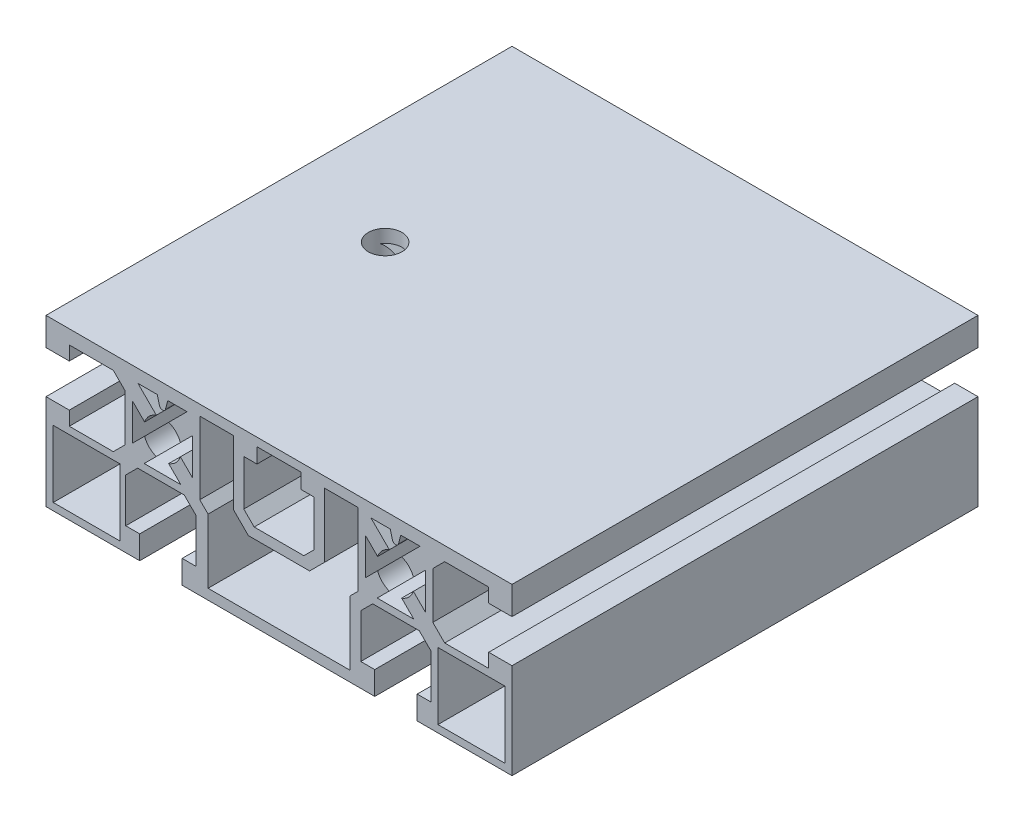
from build123d import *

# Parameters (mm, degrees)
EXTRUDE1_DEPTH             = 45
EXTRUDE1_DEPTH_BACK        = 45
SKETCH1_W                  = 12.900004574
SKETCH1_H                  = 12.900004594
SKETCH1_W_2                = 12.900004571
SKETCH1_H_2                = 12.900004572
F_6_5_6_5_DIAMETER_HOLE1_D = 6.5


with BuildPart() as part:
    # Sketch1 → Extrude1 (new, two sides: drawn at the far end of the back side and taken through both)
    with BuildSketch(Plane.XY.offset(-EXTRUDE1_DEPTH_BACK)):
        Polygon((40.499999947, 6.799999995), (40.499999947, 4.099999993), (44.999999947, 4.099999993), (44.999999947, 9.499999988), (-45.000000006, 9.499999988), (-45.000000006, 4.099999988), (-40.500000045, 4.099999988), (-40.500000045, 6.799999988), (-32.000000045, 6.799999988), (-29.700000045, 4.499999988), (-29.700000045, -4.500000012), (-32.000000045, -6.800000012), (-40.500000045, -6.800000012), (-40.500000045, -4.100000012), (-45.000000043, -4.100000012), (-45.000000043, -22.5), (-26.90000005, -22.5), (-26.90000005, -17.999999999), (-29.60000005, -17.999999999), (-29.60000005, -9.499999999), (-27.30000005, -7.199999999), (-18.30000005, -7.199999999), (-16.00000005, -9.499999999), (-16.00000005, -17.999999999), (-18.70000005, -17.999999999), (-18.70000005, -22.5), (18.490086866, -22.5), (18.490086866, -18.000000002), (15.790086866, -18.000000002), (15.790086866, -9.500000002), (18.090086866, -7.200000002), (27.090086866, -7.200000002), (29.390086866, -9.500000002), (29.390086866, -18.000000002), (26.690086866, -18.000000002), (26.690086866, -22.5), (44.999999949, -22.5), (44.999999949, -4.100000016), (40.499999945, -4.100000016), (40.499999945, -6.800000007), (31.999999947, -6.800000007), (29.699999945, -4.500000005), (29.699999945, 4.499999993), (31.999999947, 6.799999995), align=None)
        with Locations((-37.14999772, -14.649997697)):
            Rectangle(SKETCH1_W, SKETCH1_H, mode=Mode.SUBTRACT)
        with Locations((37.149997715, -14.649997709)):
            Rectangle(SKETCH1_W_2, SKETCH1_H_2, mode=Mode.SUBTRACT)
        Polygon((-13.700011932, -8.092886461), (-15.299994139, -6.492904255), (-15.300023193, 7.499999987), (-8.799988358, 7.499999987), (-8.799988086, -4.907113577), (-5.907098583, -7.80000308), (5.907098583, -7.80000308), (8.799987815, -4.907113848), (8.799988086, 7.499999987), (15.300023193, 7.499999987), (15.299994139, -6.492904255), (13.700011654, -8.092886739), (13.700011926, -20.500000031), (-13.700012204, -20.500000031), align=None, mode=Mode.SUBTRACT)
        Polygon((-6.799988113, 4.999999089), (-4.250000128, 4.999999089), (-4.250000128, 7.901067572), (4.249999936, 7.901067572), (4.249999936, 4.999999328), (6.800018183, 4.999999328), (6.800017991, -3.799988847), (4.800017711, -5.799988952), (-4.799988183, -5.799988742), (-6.799988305, -3.799988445), align=None, mode=Mode.SUBTRACT)
        with BuildLine():
            Line((-25.951118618, -1.188393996), (-28.299999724, -3.537284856))
            Line((-28.299999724, -3.537284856), (-28.299985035, 3.537270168))
            Line((-28.299985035, 3.537270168), (-25.951118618, 1.188393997))
            ThreePointArc((-25.951118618, 1.188393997), (-25.080939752, 2.580939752), (-23.688393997, 3.451118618))
            Line((-23.688393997, 3.451118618), (-27.237271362, 6.999981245))
            Line((-27.237271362, 6.999981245), (-23.523094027, 7.000016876))
            Line((-23.523094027, 7.000016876), (-23.079555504, 5.344708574))
            ThreePointArc((-23.079555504, 5.344708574), (-22.500000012, 4.900000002), (-21.920444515, 5.344708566))
            Line((-21.920444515, 5.344708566), (-21.476905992, 7.000016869))
            Line((-21.476905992, 7.000016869), (-17.762728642, 6.999981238))
            Line((-17.762728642, 6.999981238), (-21.311606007, 3.451118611))
            ThreePointArc((-21.311606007, 3.451118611), (-19.919061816, 2.580941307), (-19.048882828, 1.188398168))
            Line((-19.048882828, 1.188398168), (-16.700001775, 3.537279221))
            Line((-16.700001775, 3.537279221), (-16.700001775, -3.53726397))
            Line((-16.700001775, -3.53726397), (-19.048878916, -1.18838683))
            ThreePointArc((-19.048878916, -1.18838683), (-19.919060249, -2.580939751), (-21.31161317, -3.451121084))
            Line((-21.31161317, -3.451121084), (-18.962736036, -5.799998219))
            Line((-18.962736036, -5.799998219), (-26.037279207, -5.799998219))
            Line((-26.037279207, -5.799998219), (-23.688398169, -3.45111718))
            ThreePointArc((-23.688398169, -3.45111718), (-25.080941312, -2.580938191), (-25.951118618, -1.188393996))
        make_face(mode=Mode.SUBTRACT)
        with BuildLine():
            Line((19.048878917, -1.18838683), (16.700001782, -3.537263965))
            Line((16.700001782, -3.537263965), (16.700001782, 3.537279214))
            Line((16.700001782, 3.537279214), (19.048882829, 1.188398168))
            ThreePointArc((19.048882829, 1.188398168), (19.919061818, 2.580941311), (21.311606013, 3.451118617))
            Line((21.311606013, 3.451118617), (17.762728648, 6.999981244))
            Line((17.762728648, 6.999981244), (21.476905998, 7.000016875))
            Line((21.476905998, 7.000016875), (21.920444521, 5.344708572))
            ThreePointArc((21.920444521, 5.344708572), (22.500000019, 4.899999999), (23.079555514, 5.344708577))
            Line((23.079555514, 5.344708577), (23.523094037, 7.00001688))
            Line((23.523094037, 7.00001688), (27.237271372, 6.999981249))
            Line((27.237271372, 6.999981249), (23.688394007, 3.451118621))
            ThreePointArc((23.688394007, 3.451118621), (25.080939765, 2.580939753), (25.951118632, 1.188393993))
            Line((25.951118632, 1.188393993), (28.299985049, 3.537270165))
            Line((28.299985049, 3.537270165), (28.299999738, -3.537284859))
            Line((28.299999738, -3.537284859), (25.951118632, -1.188393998))
            ThreePointArc((25.951118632, -1.188393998), (25.080941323, -2.580938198), (23.688398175, -3.451117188))
            Line((23.688398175, -3.451117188), (26.037279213, -5.799998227))
            Line((26.037279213, -5.799998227), (18.962736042, -5.799998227))
            Line((18.962736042, -5.799998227), (21.311613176, -3.451121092))
            ThreePointArc((21.311613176, -3.451121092), (19.919060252, -2.580939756), (19.048878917, -1.18838683))
        make_face(mode=Mode.SUBTRACT)
    extrude(amount=EXTRUDE1_DEPTH + EXTRUDE1_DEPTH_BACK)

    # 6.5 _6.5_ Diameter Hole1 (through all)
    with Locations(Plane(origin=(-24.500000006, 9.499999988, 0), x_dir=(0, 0, 1), z_dir=(0, 1, 0))):
        with Locations((0, 0)):
            Hole(F_6_5_6_5_DIAMETER_HOLE1_D / 2)


solid = part.part
